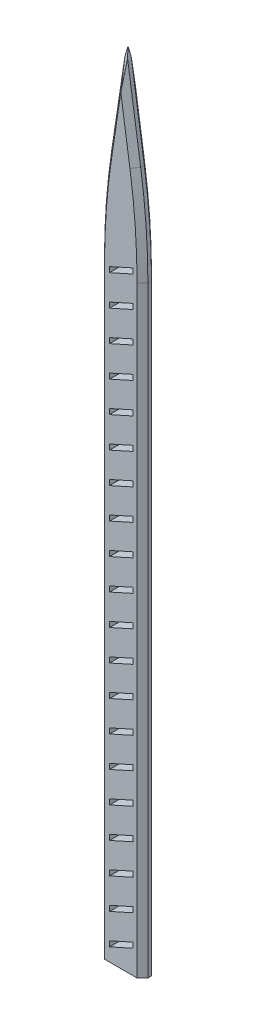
from build123d import *

# Parameters (mm, degrees)
SKETCH1_W           = 12
SKETCH1_H           = 4
BOSS_EXTRUDE1_DEPTH = 130
SKETCH3_W           = 12
SKETCH3_H           = 4
BOSS_EXTRUDE3_DEPTH = 90
CUT_EXTRUDE1_DEPTH  = 70
CHAMFER1_SIZE       = 1.5
CUT_EXTRUDE2_DEPTH  = 70
CUT_EXTRUDE3_DEPTH  = 70
LPATTERN1_COUNT     = 20
LPATTERN1_PITCH     = 8.5


with BuildPart() as part:
    # Sketch1 → Boss-Extrude1 (new body)
    with BuildSketch(Plane(origin=(0, 0, 0), x_dir=(1, 0, 0), z_dir=(0, 1, 0))):
        with Locations((-59.494460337, 30.133219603)):
            Rectangle(SKETCH1_W, SKETCH1_H)
    extrude(amount=BOSS_EXTRUDE1_DEPTH)

    # Sketch3 → Boss-Extrude3 (add)
    with BuildSketch(Plane(origin=(0, 130, 0), x_dir=(1, 0, 0), z_dir=(0, 1, 0))):
        with Locations((-59.494460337, 30.133219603)):
            Rectangle(SKETCH3_W, SKETCH3_H)
    extrude(amount=BOSS_EXTRUDE3_DEPTH)

    # Sketch4 → Cut-Extrude1 (cut)
    with BuildSketch(Plane(origin=(0, 0, -32.133219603), x_dir=(-1, 0, 0), z_dir=(0, 0, -1))):
        with BuildLine():
            Line((59.494460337, 220), (55.478258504, 193.172822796))
            ThreePointArc((55.478258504, 193.172822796), (53.991095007, 179.88460148), (53.494460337, 166.522646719))
            Line((53.494460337, 166.522646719), (53.494460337, 156.194956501))
            Line((53.494460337, 156.194956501), (48.879932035, 156.194956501))
            Line((48.879932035, 156.194956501), (48.879932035, 232.333316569))
            Line((48.879932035, 232.333316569), (75.265949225, 232.333316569))
            Line((75.265949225, 232.333316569), (75.265949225, 156.194956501))
            Line((75.265949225, 156.194956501), (65.494460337, 156.194956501))
            Line((65.494460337, 156.194956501), (65.494460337, 166.522646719))
            ThreePointArc((65.494460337, 166.522646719), (64.997825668, 179.88460148), (63.51066217, 193.172822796))
            Line((63.51066217, 193.172822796), (59.494460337, 220))
        make_face()
    extrude(amount=-CUT_EXTRUDE1_DEPTH, mode=Mode.SUBTRACT)

    # Chamfer1
    chamfer1_edges = [part.edges().sort_by_distance(p)[0] for p in [
        (-65.494460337, 83.26132336, -32.133219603),
        (-53.494460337, 83.26132336, -32.133219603),
        (-53.494460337, 83.26132336, -28.133219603),
        (-65.494460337, 83.26132336, -28.133219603),
        (-53.991095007, 179.88460148, -28.133219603),
        (-64.997825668, 179.88460148, -28.133219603),
        (-61.502561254, 206.586411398, -28.133219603),
        (-57.48635942, 206.586411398, -28.133219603),
        (-64.997825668, 179.88460148, -32.133219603),
        (-61.502561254, 206.586411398, -32.133219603),
        (-53.991095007, 179.88460148, -32.133219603),
        (-57.48635942, 206.586411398, -32.133219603),
    ]]
    chamfer(chamfer1_edges, length=CHAMFER1_SIZE)

    # Sketch5 → Cut-Extrude2 (cut)
    with BuildSketch(Plane(origin=(-53.494460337, 0, 0), x_dir=(0, 0, -1), z_dir=(1, 0, 0))):
        Polygon((30.133219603, 220), (28.133219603, 209.868734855), (28.133219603, 221.793005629), (32.649081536, 221.793005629), (32.133219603, 209.868734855), align=None)
    extrude(amount=-CUT_EXTRUDE2_DEPTH, mode=Mode.SUBTRACT)

    # Sketch6 → Cut-Extrude3 (cut)
    with BuildSketch(Plane(origin=(0, 0, -32.133219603), x_dir=(-1, 0, 0), z_dir=(0, 0, -1))):
        Polygon((56.093685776, 6.577894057), (62.59613168, 3.6517934), (62.59613168, 5.114843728), (56.093685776, 8.040944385), align=None)
    cut_extrude3 = extrude(amount=-CUT_EXTRUDE3_DEPTH, mode=Mode.SUBTRACT)

    # LPattern1: Cut-Extrude3 ×20
    with Locations(*[(0, i * LPATTERN1_PITCH, 0) for i in range(1, LPATTERN1_COUNT)]):
        add(cut_extrude3, mode=Mode.SUBTRACT)


solid = part.part
